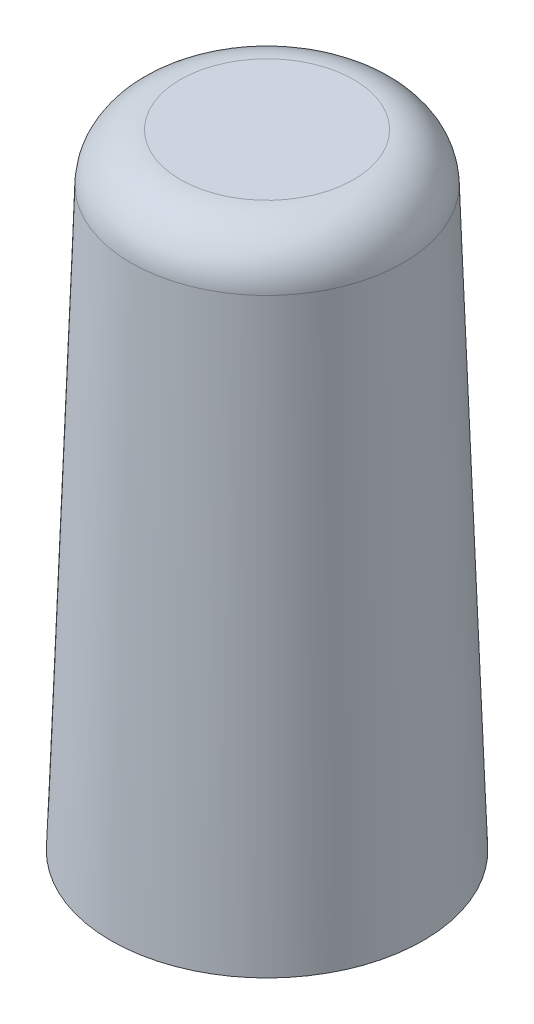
from build123d import *

# Parameters (mm, degrees)
SKETCH1_R           = 9.5
BOSS_EXTRUDE1_DEPTH = 38
BOSS_EXTRUDE1_TAPER = 2
FILLET1_R           = 3


with BuildPart() as part:
    # Sketch1 → Boss-Extrude1 (new body)
    with BuildSketch(Plane(origin=(0, 0, 0), x_dir=(1, 0, 0), z_dir=(0, 1, 0))):
        Circle(SKETCH1_R)
    extrude(amount=BOSS_EXTRUDE1_DEPTH, taper=BOSS_EXTRUDE1_TAPER)

    # Fillet1
    fillet1_edges = [part.edges().sort_by_distance(p)[0] for p in [
        (-8.173010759, 38, 0),
    ]]
    fillet(fillet1_edges, radius=FILLET1_R)


solid = part.part
